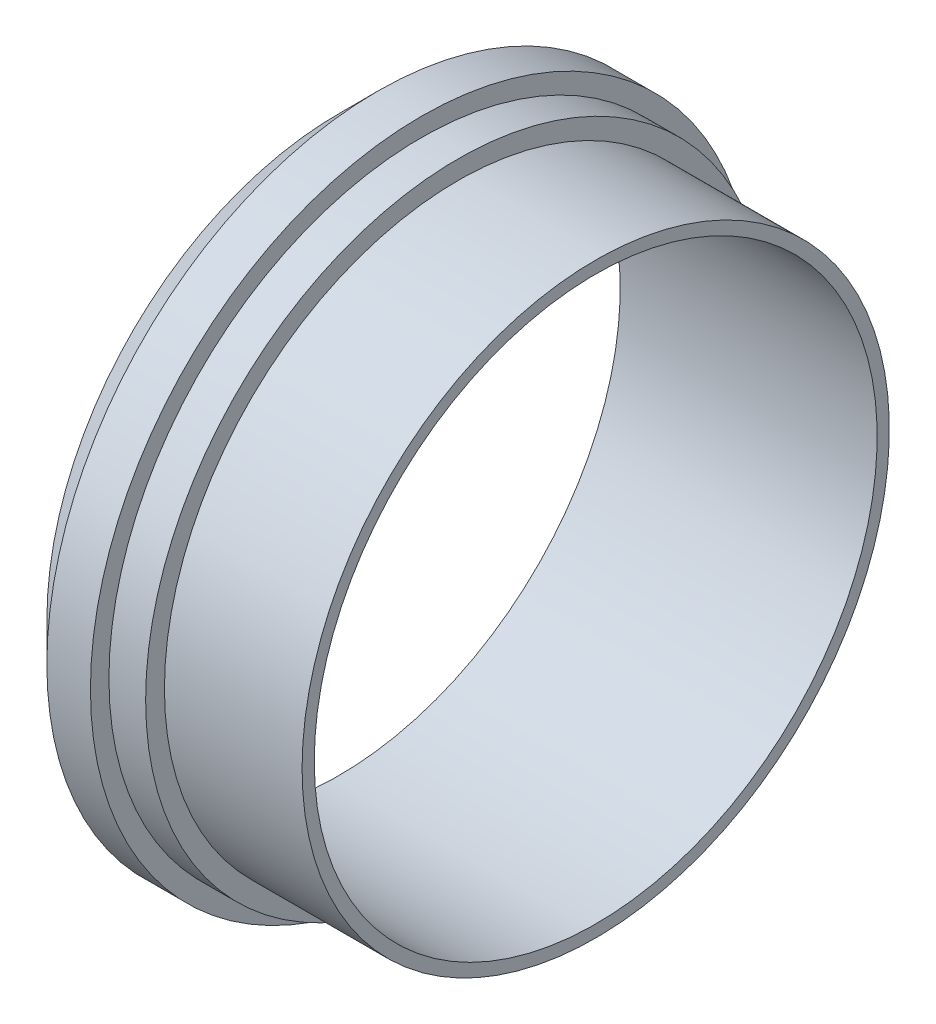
ISO-10303-21;
HEADER;
FILE_DESCRIPTION(('STEP AP214'),'2;1');
FILE_NAME('part.step','',(''),(''),'','','');
FILE_SCHEMA(('AUTOMOTIVE_DESIGN { 1 0 10303 214 1 1 1 1 }'));
ENDSEC;
DATA;
#1=APPLICATION_CONTEXT('core data for automotive mechanical design processes');
#2=APPLICATION_PROTOCOL_DEFINITION('international standard','automotive_design',2000,#1);
#3=PRODUCT_CONTEXT('',#1,'mechanical');
#4=PRODUCT('Part','Part','',(#3));
#5=PRODUCT_RELATED_PRODUCT_CATEGORY('part','',(#4));
#6=PRODUCT_DEFINITION_FORMATION('','',#4);
#7=PRODUCT_DEFINITION_CONTEXT('part definition',#1,'design');
#8=PRODUCT_DEFINITION('design','',#6,#7);
#9=PRODUCT_DEFINITION_SHAPE('','',#8);
#10=(LENGTH_UNIT() NAMED_UNIT(*) SI_UNIT(.MILLI.,.METRE.));
#11=(NAMED_UNIT(*) PLANE_ANGLE_UNIT() SI_UNIT($,.RADIAN.));
#12=(NAMED_UNIT(*) SI_UNIT($,.STERADIAN.) SOLID_ANGLE_UNIT());
#13=UNCERTAINTY_MEASURE_WITH_UNIT(LENGTH_MEASURE(1.E-05),#10,'distance_accuracy_value','');
#14=(GEOMETRIC_REPRESENTATION_CONTEXT(3) GLOBAL_UNCERTAINTY_ASSIGNED_CONTEXT((#13)) GLOBAL_UNIT_ASSIGNED_CONTEXT((#10,
#11,#12)) REPRESENTATION_CONTEXT('',''));
#15=CARTESIAN_POINT('',(0.,0.,0.));
#16=DIRECTION('',(0.,0.,1.));
#17=DIRECTION('',(1.,0.,0.));
#18=AXIS2_PLACEMENT_3D('',#15,#16,#17);
#19=CARTESIAN_POINT('',(0.,50.8,0.));
#20=DIRECTION('',(1.,0.,0.));
#21=DIRECTION('',(0.,0.,-1.));
#22=AXIS2_PLACEMENT_3D('',#19,#20,#21);
#23=PLANE('',#22);
#24=CARTESIAN_POINT('',(0.,50.8,0.));
#25=DIRECTION('',(-1.,0.,0.));
#26=DIRECTION('',(0.,0.,1.));
#27=AXIS2_PLACEMENT_3D('',#24,#25,#26);
#28=CIRCLE('',#27,48.6918);
#29=CARTESIAN_POINT('',(0.,50.8,48.6918));
#30=VERTEX_POINT('',#29);
#31=EDGE_CURVE('E59',#30,#30,#28,.T.);
#32=ORIENTED_EDGE('',*,*,#31,.T.);
#33=EDGE_LOOP('',(#32));
#34=FACE_BOUND('',#33,.T.);
#35=CARTESIAN_POINT('',(0.,50.8,0.));
#36=DIRECTION('',(-1.,0.,0.));
#37=DIRECTION('',(0.,0.,1.));
#38=AXIS2_PLACEMENT_3D('',#35,#36,#37);
#39=CIRCLE('',#38,50.8);
#40=CARTESIAN_POINT('',(0.,50.8,50.8));
#41=VERTEX_POINT('',#40);
#42=EDGE_CURVE('E10',#41,#41,#39,.T.);
#43=ORIENTED_EDGE('',*,*,#42,.F.);
#44=EDGE_LOOP('',(#43));
#45=FACE_BOUND('',#44,.T.);
#46=ADVANCED_FACE('F31',(#34,#45),#23,.T.);
#47=CARTESIAN_POINT('',(-44.45,50.8,0.));
#48=DIRECTION('',(-1.,0.,0.));
#49=DIRECTION('',(0.,0.,1.));
#50=AXIS2_PLACEMENT_3D('',#47,#48,#49);
#51=CYLINDRICAL_SURFACE('',#50,50.8);
#52=ORIENTED_EDGE('',*,*,#42,.T.);
#53=EDGE_LOOP('',(#52));
#54=FACE_BOUND('',#53,.T.);
#55=CARTESIAN_POINT('',(-23.8125,50.8,0.));
#56=DIRECTION('',(-1.,0.,0.));
#57=DIRECTION('',(0.,0.,1.));
#58=AXIS2_PLACEMENT_3D('',#55,#56,#57);
#59=CIRCLE('',#58,50.8);
#60=CARTESIAN_POINT('',(-23.8125,50.8,50.8));
#61=VERTEX_POINT('',#60);
#62=EDGE_CURVE('E37',#61,#61,#59,.T.);
#63=ORIENTED_EDGE('',*,*,#62,.F.);
#64=EDGE_LOOP('',(#63));
#65=FACE_BOUND('',#64,.T.);
#66=ADVANCED_FACE('F92',(#54,#65),#51,.T.);
#67=CARTESIAN_POINT('',(-23.8125,0.,0.));
#68=DIRECTION('',(1.,0.,0.));
#69=DIRECTION('',(0.,0.,-1.));
#70=AXIS2_PLACEMENT_3D('',#67,#68,#69);
#71=PLANE('',#70);
#72=ORIENTED_EDGE('',*,*,#62,.T.);
#73=EDGE_LOOP('',(#72));
#74=FACE_BOUND('',#73,.T.);
#75=CARTESIAN_POINT('',(-23.8125,50.8,0.));
#76=DIRECTION('',(-1.,0.,0.));
#77=DIRECTION('',(0.,0.,1.));
#78=AXIS2_PLACEMENT_3D('',#75,#76,#77);
#79=CIRCLE('',#78,54.0512);
#80=CARTESIAN_POINT('',(-23.8125,50.8,54.0512));
#81=VERTEX_POINT('',#80);
#82=EDGE_CURVE('E41',#81,#81,#79,.T.);
#83=ORIENTED_EDGE('',*,*,#82,.F.);
#84=EDGE_LOOP('',(#83));
#85=FACE_BOUND('',#84,.T.);
#86=ADVANCED_FACE('F96',(#74,#85),#71,.T.);
#87=CARTESIAN_POINT('',(-44.45,50.8,0.));
#88=DIRECTION('',(-1.,0.,0.));
#89=DIRECTION('',(0.,0.,1.));
#90=AXIS2_PLACEMENT_3D('',#87,#88,#89);
#91=CYLINDRICAL_SURFACE('',#90,54.0512);
#92=ORIENTED_EDGE('',*,*,#82,.T.);
#93=EDGE_LOOP('',(#92));
#94=FACE_BOUND('',#93,.T.);
#95=CARTESIAN_POINT('',(-30.1625,50.8,0.));
#96=DIRECTION('',(-1.,0.,0.));
#97=DIRECTION('',(0.,0.,1.));
#98=AXIS2_PLACEMENT_3D('',#95,#96,#97);
#99=CIRCLE('',#98,54.0512);
#100=CARTESIAN_POINT('',(-30.1625,50.8,54.0512));
#101=VERTEX_POINT('',#100);
#102=EDGE_CURVE('E45',#101,#101,#99,.T.);
#103=ORIENTED_EDGE('',*,*,#102,.F.);
#104=EDGE_LOOP('',(#103));
#105=FACE_BOUND('',#104,.T.);
#106=ADVANCED_FACE('F100',(#94,#105),#91,.T.);
#107=CARTESIAN_POINT('',(-30.1625,-3.25120000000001,0.));
#108=DIRECTION('',(1.,0.,0.));
#109=DIRECTION('',(0.,0.,-1.));
#110=AXIS2_PLACEMENT_3D('',#107,#108,#109);
#111=PLANE('',#110);
#112=ORIENTED_EDGE('',*,*,#102,.T.);
#113=EDGE_LOOP('',(#112));
#114=FACE_BOUND('',#113,.T.);
#115=CARTESIAN_POINT('',(-30.1625,50.8,0.));
#116=DIRECTION('',(-1.,0.,0.));
#117=DIRECTION('',(0.,0.,1.));
#118=AXIS2_PLACEMENT_3D('',#115,#116,#117);
#119=CIRCLE('',#118,57.2516);
#120=CARTESIAN_POINT('',(-30.1625,50.8,57.2516));
#121=VERTEX_POINT('',#120);
#122=EDGE_CURVE('E50',#121,#121,#119,.T.);
#123=ORIENTED_EDGE('',*,*,#122,.F.);
#124=EDGE_LOOP('',(#123));
#125=FACE_BOUND('',#124,.T.);
#126=ADVANCED_FACE('F88',(#114,#125),#111,.T.);
#127=CARTESIAN_POINT('',(-44.45,50.8,0.));
#128=DIRECTION('',(-1.,0.,0.));
#129=DIRECTION('',(0.,0.,1.));
#130=AXIS2_PLACEMENT_3D('',#127,#128,#129);
#131=CYLINDRICAL_SURFACE('',#130,57.2516);
#132=ORIENTED_EDGE('',*,*,#122,.T.);
#133=EDGE_LOOP('',(#132));
#134=FACE_BOUND('',#133,.T.);
#135=CARTESIAN_POINT('',(-37.70376,50.8,0.));
#136=DIRECTION('',(-1.,0.,0.));
#137=DIRECTION('',(0.,0.,1.));
#138=AXIS2_PLACEMENT_3D('',#135,#136,#137);
#139=CIRCLE('',#138,57.2516);
#140=CARTESIAN_POINT('',(-37.70376,50.8,57.2516));
#141=VERTEX_POINT('',#140);
#142=EDGE_CURVE('E53',#141,#141,#139,.T.);
#143=ORIENTED_EDGE('',*,*,#142,.F.);
#144=EDGE_LOOP('',(#143));
#145=FACE_BOUND('',#144,.T.);
#146=ADVANCED_FACE('F82',(#134,#145),#131,.T.);
#147=CARTESIAN_POINT('',(-44.45,50.8,0.));
#148=DIRECTION('',(1.,0.,0.));
#149=DIRECTION('',(0.,0.,-1.));
#150=AXIS2_PLACEMENT_3D('',#147,#148,#149);
#151=CONICAL_SURFACE('',#150,50.4952,0.786150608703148);
#152=ORIENTED_EDGE('',*,*,#142,.T.);
#153=EDGE_LOOP('',(#152));
#154=FACE_BOUND('',#153,.T.);
#155=CARTESIAN_POINT('',(-44.45,50.8,0.));
#156=DIRECTION('',(-1.,0.,0.));
#157=DIRECTION('',(0.,0.,1.));
#158=AXIS2_PLACEMENT_3D('',#155,#156,#157);
#159=CIRCLE('',#158,50.4952);
#160=CARTESIAN_POINT('',(-44.45,50.8,50.4952));
#161=VERTEX_POINT('',#160);
#162=EDGE_CURVE('E56',#161,#161,#159,.T.);
#163=ORIENTED_EDGE('',*,*,#162,.F.);
#164=EDGE_LOOP('',(#163));
#165=FACE_BOUND('',#164,.T.);
#166=ADVANCED_FACE('F77',(#154,#165),#151,.T.);
#167=CARTESIAN_POINT('',(-44.45,0.304800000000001,0.));
#168=DIRECTION('',(-1.,0.,0.));
#169=DIRECTION('',(0.,0.,1.));
#170=AXIS2_PLACEMENT_3D('',#167,#168,#169);
#171=PLANE('',#170);
#172=CARTESIAN_POINT('',(-44.45,50.8,0.));
#173=DIRECTION('',(-1.,0.,0.));
#174=DIRECTION('',(0.,0.,1.));
#175=AXIS2_PLACEMENT_3D('',#172,#173,#174);
#176=CIRCLE('',#175,48.6918);
#177=CARTESIAN_POINT('',(-44.45,50.8,48.6918));
#178=VERTEX_POINT('',#177);
#179=EDGE_CURVE('E60',#178,#178,#176,.T.);
#180=ORIENTED_EDGE('',*,*,#179,.F.);
#181=EDGE_LOOP('',(#180));
#182=FACE_BOUND('',#181,.T.);
#183=ORIENTED_EDGE('',*,*,#162,.T.);
#184=EDGE_LOOP('',(#183));
#185=FACE_BOUND('',#184,.T.);
#186=ADVANCED_FACE('F71',(#182,#185),#171,.T.);
#187=CARTESIAN_POINT('',(0.,50.8,0.));
#188=DIRECTION('',(-1.,0.,0.));
#189=DIRECTION('',(0.,0.,1.));
#190=AXIS2_PLACEMENT_3D('',#187,#188,#189);
#191=CYLINDRICAL_SURFACE('',#190,48.6918);
#192=ORIENTED_EDGE('',*,*,#31,.F.);
#193=EDGE_LOOP('',(#192));
#194=FACE_BOUND('',#193,.T.);
#195=ORIENTED_EDGE('',*,*,#179,.T.);
#196=EDGE_LOOP('',(#195));
#197=FACE_BOUND('',#196,.T.);
#198=ADVANCED_FACE('F68',(#194,#197),#191,.F.);
#199=CLOSED_SHELL('',(#46,#66,#86,#106,#126,#146,#166,#186,#198));
#200=MANIFOLD_SOLID_BREP('B2',#199);
#201=ADVANCED_BREP_SHAPE_REPRESENTATION('',(#18,#200),#14);
#202=SHAPE_DEFINITION_REPRESENTATION(#9,#201);
ENDSEC;
END-ISO-10303-21;
